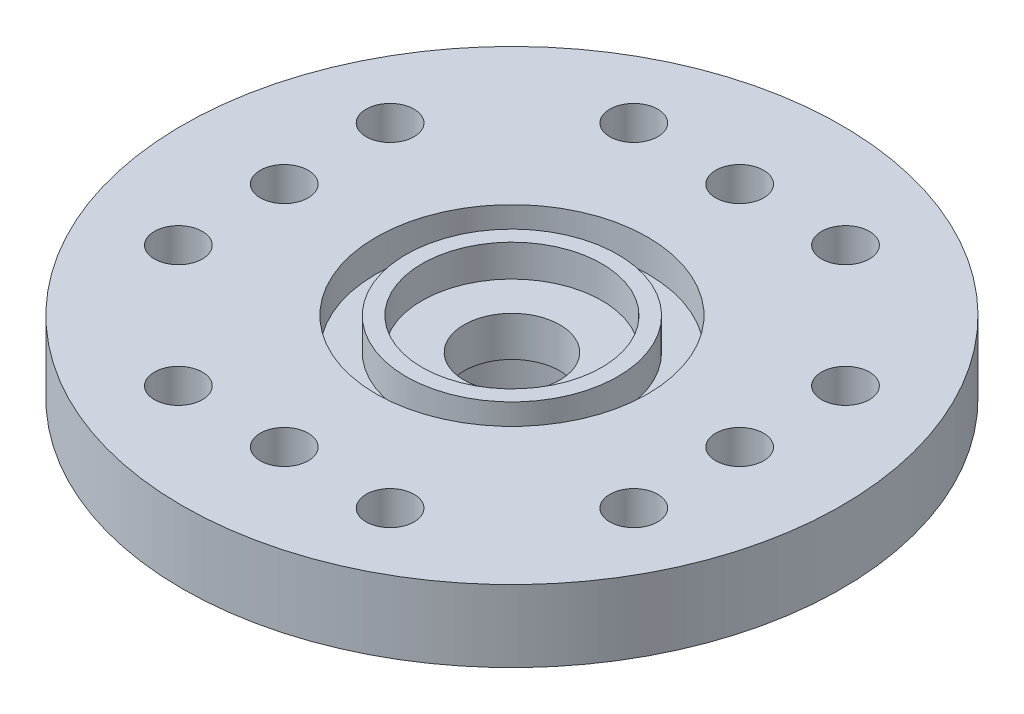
ISO-10303-21;
HEADER;
FILE_DESCRIPTION(('STEP AP214'),'2;1');
FILE_NAME('part.step','',(''),(''),'','','');
FILE_SCHEMA(('AUTOMOTIVE_DESIGN { 1 0 10303 214 1 1 1 1 }'));
ENDSEC;
DATA;
#1=APPLICATION_CONTEXT('core data for automotive mechanical design processes');
#2=APPLICATION_PROTOCOL_DEFINITION('international standard','automotive_design',2000,#1);
#3=PRODUCT_CONTEXT('',#1,'mechanical');
#4=PRODUCT('Part','Part','',(#3));
#5=PRODUCT_RELATED_PRODUCT_CATEGORY('part','',(#4));
#6=PRODUCT_DEFINITION_FORMATION('','',#4);
#7=PRODUCT_DEFINITION_CONTEXT('part definition',#1,'design');
#8=PRODUCT_DEFINITION('design','',#6,#7);
#9=PRODUCT_DEFINITION_SHAPE('','',#8);
#10=(LENGTH_UNIT() NAMED_UNIT(*) SI_UNIT(.MILLI.,.METRE.));
#11=(NAMED_UNIT(*) PLANE_ANGLE_UNIT() SI_UNIT($,.RADIAN.));
#12=(NAMED_UNIT(*) SI_UNIT($,.STERADIAN.) SOLID_ANGLE_UNIT());
#13=UNCERTAINTY_MEASURE_WITH_UNIT(LENGTH_MEASURE(1.E-05),#10,'distance_accuracy_value','');
#14=(GEOMETRIC_REPRESENTATION_CONTEXT(3) GLOBAL_UNCERTAINTY_ASSIGNED_CONTEXT((#13)) GLOBAL_UNIT_ASSIGNED_CONTEXT((#10,
#11,#12)) REPRESENTATION_CONTEXT('',''));
#15=CARTESIAN_POINT('',(0.,0.,0.));
#16=DIRECTION('',(0.,0.,1.));
#17=DIRECTION('',(1.,0.,0.));
#18=AXIS2_PLACEMENT_3D('',#15,#16,#17);
#19=CARTESIAN_POINT('',(0.,0.,0.));
#20=DIRECTION('',(0.,1.,0.));
#21=DIRECTION('',(0.,0.,1.));
#22=AXIS2_PLACEMENT_3D('',#19,#20,#21);
#23=PLANE('',#22);
#24=CARTESIAN_POINT('',(0.,0.,0.));
#25=DIRECTION('',(0.,1.,0.));
#26=DIRECTION('',(0.,0.,1.));
#27=AXIS2_PLACEMENT_3D('',#24,#25,#26);
#28=CIRCLE('',#27,1.524);
#29=CARTESIAN_POINT('',(0.,0.,1.524));
#30=VERTEX_POINT('',#29);
#31=EDGE_CURVE('E73',#30,#30,#28,.T.);
#32=ORIENTED_EDGE('',*,*,#31,.T.);
#33=EDGE_LOOP('',(#32));
#34=FACE_BOUND('',#33,.T.);
#35=CARTESIAN_POINT('',(0.,0.,0.));
#36=DIRECTION('',(0.,-1.,0.));
#37=DIRECTION('',(0.,0.,-1.));
#38=AXIS2_PLACEMENT_3D('',#35,#36,#37);
#39=CIRCLE('',#38,3.175);
#40=CARTESIAN_POINT('',(0.,0.,3.175));
#41=VERTEX_POINT('',#40);
#42=EDGE_CURVE('E157',#41,#41,#39,.T.);
#43=ORIENTED_EDGE('',*,*,#42,.T.);
#44=EDGE_LOOP('',(#43));
#45=FACE_BOUND('',#44,.T.);
#46=ADVANCED_FACE('F40',(#34,#45),#23,.F.);
#47=CARTESIAN_POINT('',(0.,2.286,0.));
#48=DIRECTION('',(0.,-1.,0.));
#49=DIRECTION('',(0.,0.,-1.));
#50=AXIS2_PLACEMENT_3D('',#47,#48,#49);
#51=CYLINDRICAL_SURFACE('',#50,1.524);
#52=ORIENTED_EDGE('',*,*,#31,.F.);
#53=EDGE_LOOP('',(#52));
#54=FACE_BOUND('',#53,.T.);
#55=CARTESIAN_POINT('',(0.,1.27,0.));
#56=DIRECTION('',(0.,1.,0.));
#57=DIRECTION('',(0.,0.,1.));
#58=AXIS2_PLACEMENT_3D('',#55,#56,#57);
#59=CIRCLE('',#58,1.524);
#60=CARTESIAN_POINT('',(0.,1.27,1.524));
#61=VERTEX_POINT('',#60);
#62=EDGE_CURVE('E136',#61,#61,#59,.F.);
#63=ORIENTED_EDGE('',*,*,#62,.F.);
#64=EDGE_LOOP('',(#63));
#65=FACE_BOUND('',#64,.T.);
#66=ADVANCED_FACE('F183',(#54,#65),#51,.F.);
#67=CARTESIAN_POINT('',(0.,2.286,0.));
#68=DIRECTION('',(0.,1.,0.));
#69=DIRECTION('',(0.,0.,1.));
#70=AXIS2_PLACEMENT_3D('',#67,#68,#69);
#71=PLANE('',#70);
#72=CARTESIAN_POINT('',(0.,2.286,0.));
#73=DIRECTION('',(0.,1.,0.));
#74=DIRECTION('',(0.,0.,1.));
#75=AXIS2_PLACEMENT_3D('',#72,#73,#74);
#76=CIRCLE('',#75,4.318);
#77=CARTESIAN_POINT('',(0.,2.286,4.318));
#78=VERTEX_POINT('',#77);
#79=EDGE_CURVE('E142',#78,#78,#76,.T.);
#80=ORIENTED_EDGE('',*,*,#79,.F.);
#81=EDGE_LOOP('',(#80));
#82=FACE_BOUND('',#81,.T.);
#83=CARTESIAN_POINT('',(-7.2390000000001,2.286,1.00180280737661E-13));
#84=DIRECTION('',(0.,1.,0.));
#85=DIRECTION('',(0.,0.,1.));
#86=AXIS2_PLACEMENT_3D('',#83,#84,#85);
#87=CIRCLE('',#86,0.761999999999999);
#88=CARTESIAN_POINT('',(-7.2390000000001,2.286,0.7620000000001));
#89=VERTEX_POINT('',#88);
#90=EDGE_CURVE('E118',#89,#89,#87,.T.);
#91=ORIENTED_EDGE('',*,*,#90,.F.);
#92=EDGE_LOOP('',(#91));
#93=FACE_BOUND('',#92,.T.);
#94=CARTESIAN_POINT('',(3.3655,2.286,7.2390000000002));
#95=DIRECTION('',(0.,1.,0.));
#96=DIRECTION('',(0.,0.,1.));
#97=AXIS2_PLACEMENT_3D('',#94,#95,#96);
#98=CIRCLE('',#97,0.761999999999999);
#99=CARTESIAN_POINT('',(3.3655,2.286,8.0010000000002));
#100=VERTEX_POINT('',#99);
#101=EDGE_CURVE('E106',#100,#100,#98,.T.);
#102=ORIENTED_EDGE('',*,*,#101,.F.);
#103=EDGE_LOOP('',(#102));
#104=FACE_BOUND('',#103,.T.);
#105=CARTESIAN_POINT('',(-3.3655,2.286,7.2390000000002));
#106=DIRECTION('',(0.,1.,0.));
#107=DIRECTION('',(0.,0.,1.));
#108=AXIS2_PLACEMENT_3D('',#105,#106,#107);
#109=CIRCLE('',#108,0.762);
#110=CARTESIAN_POINT('',(-3.3655,2.286,8.0010000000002));
#111=VERTEX_POINT('',#110);
#112=EDGE_CURVE('E94',#111,#111,#109,.T.);
#113=ORIENTED_EDGE('',*,*,#112,.F.);
#114=EDGE_LOOP('',(#113));
#115=FACE_BOUND('',#114,.T.);
#116=CARTESIAN_POINT('',(7.2390000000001,2.286,0.));
#117=DIRECTION('',(0.,1.,0.));
#118=DIRECTION('',(0.,0.,1.));
#119=AXIS2_PLACEMENT_3D('',#116,#117,#118);
#120=CIRCLE('',#119,0.762000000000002);
#121=CARTESIAN_POINT('',(7.2390000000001,2.286,0.7620000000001));
#122=VERTEX_POINT('',#121);
#123=EDGE_CURVE('E82',#122,#122,#120,.T.);
#124=ORIENTED_EDGE('',*,*,#123,.F.);
#125=EDGE_LOOP('',(#124));
#126=FACE_BOUND('',#125,.T.);
#127=CARTESIAN_POINT('',(0.,2.286,-7.239));
#128=DIRECTION('',(0.,1.,0.));
#129=DIRECTION('',(0.,0.,1.));
#130=AXIS2_PLACEMENT_3D('',#127,#128,#129);
#131=CIRCLE('',#130,0.762);
#132=CARTESIAN_POINT('',(0.,2.286,-6.477));
#133=VERTEX_POINT('',#132);
#134=EDGE_CURVE('E61',#133,#133,#131,.T.);
#135=ORIENTED_EDGE('',*,*,#134,.F.);
#136=EDGE_LOOP('',(#135));
#137=FACE_BOUND('',#136,.T.);
#138=CARTESIAN_POINT('',(0.,2.286,0.));
#139=DIRECTION('',(0.,1.,0.));
#140=DIRECTION('',(0.,0.,1.));
#141=AXIS2_PLACEMENT_3D('',#138,#139,#140);
#142=CIRCLE('',#141,10.4775);
#143=CARTESIAN_POINT('',(0.,2.286,10.4775));
#144=VERTEX_POINT('',#143);
#145=EDGE_CURVE('E47',#144,#144,#142,.T.);
#146=ORIENTED_EDGE('',*,*,#145,.T.);
#147=EDGE_LOOP('',(#146));
#148=FACE_BOUND('',#147,.T.);
#149=CARTESIAN_POINT('',(3.3655,2.286,-7.239));
#150=DIRECTION('',(0.,1.,0.));
#151=DIRECTION('',(0.,0.,1.));
#152=AXIS2_PLACEMENT_3D('',#149,#150,#151);
#153=CIRCLE('',#152,0.762);
#154=CARTESIAN_POINT('',(3.3655,2.286,-6.477));
#155=VERTEX_POINT('',#154);
#156=EDGE_CURVE('E56',#155,#155,#153,.T.);
#157=ORIENTED_EDGE('',*,*,#156,.F.);
#158=EDGE_LOOP('',(#157));
#159=FACE_BOUND('',#158,.T.);
#160=CARTESIAN_POINT('',(-3.3655,2.286,-7.239));
#161=DIRECTION('',(0.,1.,0.));
#162=DIRECTION('',(0.,0.,1.));
#163=AXIS2_PLACEMENT_3D('',#160,#161,#162);
#164=CIRCLE('',#163,0.762);
#165=CARTESIAN_POINT('',(-3.3655,2.286,-6.477));
#166=VERTEX_POINT('',#165);
#167=EDGE_CURVE('E67',#166,#166,#164,.T.);
#168=ORIENTED_EDGE('',*,*,#167,.F.);
#169=EDGE_LOOP('',(#168));
#170=FACE_BOUND('',#169,.T.);
#171=CARTESIAN_POINT('',(7.2390000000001,2.286,3.3655000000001));
#172=DIRECTION('',(0.,1.,0.));
#173=DIRECTION('',(0.,0.,1.));
#174=AXIS2_PLACEMENT_3D('',#171,#172,#173);
#175=CIRCLE('',#174,0.762000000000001);
#176=CARTESIAN_POINT('',(7.2390000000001,2.286,4.1275000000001));
#177=VERTEX_POINT('',#176);
#178=EDGE_CURVE('E78',#177,#177,#175,.T.);
#179=ORIENTED_EDGE('',*,*,#178,.F.);
#180=EDGE_LOOP('',(#179));
#181=FACE_BOUND('',#180,.T.);
#182=CARTESIAN_POINT('',(7.2390000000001,2.286,-3.3654999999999));
#183=DIRECTION('',(0.,1.,0.));
#184=DIRECTION('',(0.,0.,1.));
#185=AXIS2_PLACEMENT_3D('',#182,#183,#184);
#186=CIRCLE('',#185,0.762000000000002);
#187=CARTESIAN_POINT('',(7.2390000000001,2.286,-2.6034999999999));
#188=VERTEX_POINT('',#187);
#189=EDGE_CURVE('E88',#188,#188,#186,.T.);
#190=ORIENTED_EDGE('',*,*,#189,.F.);
#191=EDGE_LOOP('',(#190));
#192=FACE_BOUND('',#191,.T.);
#193=CARTESIAN_POINT('',(0.,2.286,7.2390000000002));
#194=DIRECTION('',(0.,1.,0.));
#195=DIRECTION('',(0.,0.,1.));
#196=AXIS2_PLACEMENT_3D('',#193,#194,#195);
#197=CIRCLE('',#196,0.762);
#198=CARTESIAN_POINT('',(0.,2.286,8.0010000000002));
#199=VERTEX_POINT('',#198);
#200=EDGE_CURVE('E100',#199,#199,#197,.T.);
#201=ORIENTED_EDGE('',*,*,#200,.F.);
#202=EDGE_LOOP('',(#201));
#203=FACE_BOUND('',#202,.T.);
#204=CARTESIAN_POINT('',(-7.2390000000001,2.286,-3.3654999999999));
#205=DIRECTION('',(0.,1.,0.));
#206=DIRECTION('',(0.,0.,1.));
#207=AXIS2_PLACEMENT_3D('',#204,#205,#206);
#208=CIRCLE('',#207,0.761999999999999);
#209=CARTESIAN_POINT('',(-7.2390000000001,2.286,-2.6034999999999));
#210=VERTEX_POINT('',#209);
#211=EDGE_CURVE('E112',#210,#210,#208,.T.);
#212=ORIENTED_EDGE('',*,*,#211,.F.);
#213=EDGE_LOOP('',(#212));
#214=FACE_BOUND('',#213,.T.);
#215=CARTESIAN_POINT('',(-7.2390000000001,2.286,3.3655000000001));
#216=DIRECTION('',(0.,1.,0.));
#217=DIRECTION('',(0.,0.,1.));
#218=AXIS2_PLACEMENT_3D('',#215,#216,#217);
#219=CIRCLE('',#218,0.761999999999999);
#220=CARTESIAN_POINT('',(-7.2390000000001,2.286,4.1275000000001));
#221=VERTEX_POINT('',#220);
#222=EDGE_CURVE('E124',#221,#221,#219,.T.);
#223=ORIENTED_EDGE('',*,*,#222,.F.);
#224=EDGE_LOOP('',(#223));
#225=FACE_BOUND('',#224,.T.);
#226=ADVANCED_FACE('F189',(#82,#93,#104,#115,#126,#137,#148,#159,#170,#181,#192,#203,#214,#225),
#71,.T.);
#227=CARTESIAN_POINT('',(0.,0.,0.));
#228=DIRECTION('',(0.,1.,0.));
#229=DIRECTION('',(0.,0.,1.));
#230=AXIS2_PLACEMENT_3D('',#227,#228,#229);
#231=CIRCLE('',#230,4.3815);
#232=CARTESIAN_POINT('',(0.,0.,4.3815));
#233=VERTEX_POINT('',#232);
#234=EDGE_CURVE('E11',#233,#233,#231,.F.);
#235=ORIENTED_EDGE('',*,*,#234,.F.);
#236=EDGE_LOOP('',(#235));
#237=FACE_BOUND('',#236,.T.);
#238=CARTESIAN_POINT('',(0.,0.,0.));
#239=DIRECTION('',(0.,1.,0.));
#240=DIRECTION('',(0.,0.,1.));
#241=AXIS2_PLACEMENT_3D('',#238,#239,#240);
#242=CIRCLE('',#241,10.4775);
#243=CARTESIAN_POINT('',(0.,0.,10.4775));
#244=VERTEX_POINT('',#243);
#245=EDGE_CURVE('E51',#244,#244,#242,.T.);
#246=ORIENTED_EDGE('',*,*,#245,.F.);
#247=EDGE_LOOP('',(#246));
#248=FACE_BOUND('',#247,.T.);
#249=CARTESIAN_POINT('',(3.3655,0.,-7.239));
#250=DIRECTION('',(0.,1.,0.));
#251=DIRECTION('',(0.,0.,1.));
#252=AXIS2_PLACEMENT_3D('',#249,#250,#251);
#253=CIRCLE('',#252,0.762);
#254=CARTESIAN_POINT('',(3.3655,0.,-6.477));
#255=VERTEX_POINT('',#254);
#256=EDGE_CURVE('E58',#255,#255,#253,.T.);
#257=ORIENTED_EDGE('',*,*,#256,.T.);
#258=EDGE_LOOP('',(#257));
#259=FACE_BOUND('',#258,.T.);
#260=CARTESIAN_POINT('',(0.,0.,-7.239));
#261=DIRECTION('',(0.,1.,0.));
#262=DIRECTION('',(0.,0.,1.));
#263=AXIS2_PLACEMENT_3D('',#260,#261,#262);
#264=CIRCLE('',#263,0.762);
#265=CARTESIAN_POINT('',(0.,0.,-6.477));
#266=VERTEX_POINT('',#265);
#267=EDGE_CURVE('E64',#266,#266,#264,.T.);
#268=ORIENTED_EDGE('',*,*,#267,.T.);
#269=EDGE_LOOP('',(#268));
#270=FACE_BOUND('',#269,.T.);
#271=CARTESIAN_POINT('',(-3.3655,0.,-7.239));
#272=DIRECTION('',(0.,1.,0.));
#273=DIRECTION('',(0.,0.,1.));
#274=AXIS2_PLACEMENT_3D('',#271,#272,#273);
#275=CIRCLE('',#274,0.762);
#276=CARTESIAN_POINT('',(-3.3655,0.,-6.477));
#277=VERTEX_POINT('',#276);
#278=EDGE_CURVE('E70',#277,#277,#275,.T.);
#279=ORIENTED_EDGE('',*,*,#278,.T.);
#280=EDGE_LOOP('',(#279));
#281=FACE_BOUND('',#280,.T.);
#282=CARTESIAN_POINT('',(7.2390000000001,0.,3.3655000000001));
#283=DIRECTION('',(0.,1.,0.));
#284=DIRECTION('',(0.,0.,1.));
#285=AXIS2_PLACEMENT_3D('',#282,#283,#284);
#286=CIRCLE('',#285,0.762000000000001);
#287=CARTESIAN_POINT('',(7.2390000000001,0.,4.1275000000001));
#288=VERTEX_POINT('',#287);
#289=EDGE_CURVE('E79',#288,#288,#286,.T.);
#290=ORIENTED_EDGE('',*,*,#289,.T.);
#291=EDGE_LOOP('',(#290));
#292=FACE_BOUND('',#291,.T.);
#293=CARTESIAN_POINT('',(7.2390000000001,0.,0.));
#294=DIRECTION('',(0.,1.,0.));
#295=DIRECTION('',(0.,0.,1.));
#296=AXIS2_PLACEMENT_3D('',#293,#294,#295);
#297=CIRCLE('',#296,0.762000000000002);
#298=CARTESIAN_POINT('',(7.2390000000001,0.,0.7620000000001));
#299=VERTEX_POINT('',#298);
#300=EDGE_CURVE('E85',#299,#299,#297,.T.);
#301=ORIENTED_EDGE('',*,*,#300,.T.);
#302=EDGE_LOOP('',(#301));
#303=FACE_BOUND('',#302,.T.);
#304=CARTESIAN_POINT('',(7.2390000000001,0.,-3.3654999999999));
#305=DIRECTION('',(0.,1.,0.));
#306=DIRECTION('',(0.,0.,1.));
#307=AXIS2_PLACEMENT_3D('',#304,#305,#306);
#308=CIRCLE('',#307,0.762000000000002);
#309=CARTESIAN_POINT('',(7.2390000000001,0.,-2.6034999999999));
#310=VERTEX_POINT('',#309);
#311=EDGE_CURVE('E91',#310,#310,#308,.T.);
#312=ORIENTED_EDGE('',*,*,#311,.T.);
#313=EDGE_LOOP('',(#312));
#314=FACE_BOUND('',#313,.T.);
#315=CARTESIAN_POINT('',(-3.3655,0.,7.2390000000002));
#316=DIRECTION('',(0.,1.,0.));
#317=DIRECTION('',(0.,0.,1.));
#318=AXIS2_PLACEMENT_3D('',#315,#316,#317);
#319=CIRCLE('',#318,0.762);
#320=CARTESIAN_POINT('',(-3.3655,0.,8.0010000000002));
#321=VERTEX_POINT('',#320);
#322=EDGE_CURVE('E97',#321,#321,#319,.T.);
#323=ORIENTED_EDGE('',*,*,#322,.T.);
#324=EDGE_LOOP('',(#323));
#325=FACE_BOUND('',#324,.T.);
#326=CARTESIAN_POINT('',(0.,0.,7.2390000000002));
#327=DIRECTION('',(0.,1.,0.));
#328=DIRECTION('',(0.,0.,1.));
#329=AXIS2_PLACEMENT_3D('',#326,#327,#328);
#330=CIRCLE('',#329,0.762);
#331=CARTESIAN_POINT('',(0.,0.,8.0010000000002));
#332=VERTEX_POINT('',#331);
#333=EDGE_CURVE('E103',#332,#332,#330,.T.);
#334=ORIENTED_EDGE('',*,*,#333,.T.);
#335=EDGE_LOOP('',(#334));
#336=FACE_BOUND('',#335,.T.);
#337=CARTESIAN_POINT('',(3.3655,0.,7.2390000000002));
#338=DIRECTION('',(0.,1.,0.));
#339=DIRECTION('',(0.,0.,1.));
#340=AXIS2_PLACEMENT_3D('',#337,#338,#339);
#341=CIRCLE('',#340,0.761999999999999);
#342=CARTESIAN_POINT('',(3.3655,0.,8.0010000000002));
#343=VERTEX_POINT('',#342);
#344=EDGE_CURVE('E109',#343,#343,#341,.T.);
#345=ORIENTED_EDGE('',*,*,#344,.T.);
#346=EDGE_LOOP('',(#345));
#347=FACE_BOUND('',#346,.T.);
#348=CARTESIAN_POINT('',(-7.2390000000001,0.,-3.3654999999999));
#349=DIRECTION('',(0.,1.,0.));
#350=DIRECTION('',(0.,0.,1.));
#351=AXIS2_PLACEMENT_3D('',#348,#349,#350);
#352=CIRCLE('',#351,0.761999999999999);
#353=CARTESIAN_POINT('',(-7.2390000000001,0.,-2.6034999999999));
#354=VERTEX_POINT('',#353);
#355=EDGE_CURVE('E115',#354,#354,#352,.T.);
#356=ORIENTED_EDGE('',*,*,#355,.T.);
#357=EDGE_LOOP('',(#356));
#358=FACE_BOUND('',#357,.T.);
#359=CARTESIAN_POINT('',(-7.2390000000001,0.,1.00180280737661E-13));
#360=DIRECTION('',(0.,1.,0.));
#361=DIRECTION('',(0.,0.,1.));
#362=AXIS2_PLACEMENT_3D('',#359,#360,#361);
#363=CIRCLE('',#362,0.761999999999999);
#364=CARTESIAN_POINT('',(-7.2390000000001,0.,0.7620000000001));
#365=VERTEX_POINT('',#364);
#366=EDGE_CURVE('E121',#365,#365,#363,.T.);
#367=ORIENTED_EDGE('',*,*,#366,.T.);
#368=EDGE_LOOP('',(#367));
#369=FACE_BOUND('',#368,.T.);
#370=CARTESIAN_POINT('',(-7.2390000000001,0.,3.3655000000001));
#371=DIRECTION('',(0.,1.,0.));
#372=DIRECTION('',(0.,0.,1.));
#373=AXIS2_PLACEMENT_3D('',#370,#371,#372);
#374=CIRCLE('',#373,0.761999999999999);
#375=CARTESIAN_POINT('',(-7.2390000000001,0.,4.1275000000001));
#376=VERTEX_POINT('',#375);
#377=EDGE_CURVE('E127',#376,#376,#374,.T.);
#378=ORIENTED_EDGE('',*,*,#377,.T.);
#379=EDGE_LOOP('',(#378));
#380=FACE_BOUND('',#379,.T.);
#381=ADVANCED_FACE('F185',(#237,#248,#259,#270,#281,#292,#303,#314,#325,#336,#347,#358,#369,
#380),#23,.F.);
#382=CARTESIAN_POINT('',(0.,2.286,0.));
#383=DIRECTION('',(0.,-1.,0.));
#384=DIRECTION('',(0.,0.,-1.));
#385=AXIS2_PLACEMENT_3D('',#382,#383,#384);
#386=CYLINDRICAL_SURFACE('',#385,10.4775);
#387=ORIENTED_EDGE('',*,*,#145,.F.);
#388=EDGE_LOOP('',(#387));
#389=FACE_BOUND('',#388,.T.);
#390=ORIENTED_EDGE('',*,*,#245,.T.);
#391=EDGE_LOOP('',(#390));
#392=FACE_BOUND('',#391,.T.);
#393=ADVANCED_FACE('F42',(#389,#392),#386,.T.);
#394=CARTESIAN_POINT('',(3.3655,2.286,-7.239));
#395=DIRECTION('',(0.,-1.,0.));
#396=DIRECTION('',(0.,0.,-1.));
#397=AXIS2_PLACEMENT_3D('',#394,#395,#396);
#398=CYLINDRICAL_SURFACE('',#397,0.762);
#399=ORIENTED_EDGE('',*,*,#156,.T.);
#400=EDGE_LOOP('',(#399));
#401=FACE_BOUND('',#400,.T.);
#402=ORIENTED_EDGE('',*,*,#256,.F.);
#403=EDGE_LOOP('',(#402));
#404=FACE_BOUND('',#403,.T.);
#405=ADVANCED_FACE('F200',(#401,#404),#398,.F.);
#406=CARTESIAN_POINT('',(0.,2.286,-7.239));
#407=DIRECTION('',(0.,-1.,0.));
#408=DIRECTION('',(0.,0.,-1.));
#409=AXIS2_PLACEMENT_3D('',#406,#407,#408);
#410=CYLINDRICAL_SURFACE('',#409,0.762);
#411=ORIENTED_EDGE('',*,*,#134,.T.);
#412=EDGE_LOOP('',(#411));
#413=FACE_BOUND('',#412,.T.);
#414=ORIENTED_EDGE('',*,*,#267,.F.);
#415=EDGE_LOOP('',(#414));
#416=FACE_BOUND('',#415,.T.);
#417=ADVANCED_FACE('F279',(#413,#416),#410,.F.);
#418=CARTESIAN_POINT('',(-3.3655,2.286,-7.239));
#419=DIRECTION('',(0.,-1.,0.));
#420=DIRECTION('',(0.,0.,-1.));
#421=AXIS2_PLACEMENT_3D('',#418,#419,#420);
#422=CYLINDRICAL_SURFACE('',#421,0.762);
#423=ORIENTED_EDGE('',*,*,#167,.T.);
#424=EDGE_LOOP('',(#423));
#425=FACE_BOUND('',#424,.T.);
#426=ORIENTED_EDGE('',*,*,#278,.F.);
#427=EDGE_LOOP('',(#426));
#428=FACE_BOUND('',#427,.T.);
#429=ADVANCED_FACE('F274',(#425,#428),#422,.F.);
#430=CARTESIAN_POINT('',(7.2390000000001,2.286,3.3655000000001));
#431=DIRECTION('',(0.,-1.,0.));
#432=DIRECTION('',(0.,0.,-1.));
#433=AXIS2_PLACEMENT_3D('',#430,#431,#432);
#434=CYLINDRICAL_SURFACE('',#433,0.762000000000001);
#435=ORIENTED_EDGE('',*,*,#178,.T.);
#436=EDGE_LOOP('',(#435));
#437=FACE_BOUND('',#436,.T.);
#438=ORIENTED_EDGE('',*,*,#289,.F.);
#439=EDGE_LOOP('',(#438));
#440=FACE_BOUND('',#439,.T.);
#441=ADVANCED_FACE('F271',(#437,#440),#434,.F.);
#442=CARTESIAN_POINT('',(7.2390000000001,2.286,0.));
#443=DIRECTION('',(0.,-1.,0.));
#444=DIRECTION('',(0.,0.,-1.));
#445=AXIS2_PLACEMENT_3D('',#442,#443,#444);
#446=CYLINDRICAL_SURFACE('',#445,0.762000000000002);
#447=ORIENTED_EDGE('',*,*,#123,.T.);
#448=EDGE_LOOP('',(#447));
#449=FACE_BOUND('',#448,.T.);
#450=ORIENTED_EDGE('',*,*,#300,.F.);
#451=EDGE_LOOP('',(#450));
#452=FACE_BOUND('',#451,.T.);
#453=ADVANCED_FACE('F267',(#449,#452),#446,.F.);
#454=CARTESIAN_POINT('',(7.2390000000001,2.286,-3.3654999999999));
#455=DIRECTION('',(0.,-1.,0.));
#456=DIRECTION('',(0.,0.,-1.));
#457=AXIS2_PLACEMENT_3D('',#454,#455,#456);
#458=CYLINDRICAL_SURFACE('',#457,0.762000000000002);
#459=ORIENTED_EDGE('',*,*,#189,.T.);
#460=EDGE_LOOP('',(#459));
#461=FACE_BOUND('',#460,.T.);
#462=ORIENTED_EDGE('',*,*,#311,.F.);
#463=EDGE_LOOP('',(#462));
#464=FACE_BOUND('',#463,.T.);
#465=ADVANCED_FACE('F263',(#461,#464),#458,.F.);
#466=CARTESIAN_POINT('',(-3.3655,2.286,7.2390000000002));
#467=DIRECTION('',(0.,-1.,0.));
#468=DIRECTION('',(0.,0.,-1.));
#469=AXIS2_PLACEMENT_3D('',#466,#467,#468);
#470=CYLINDRICAL_SURFACE('',#469,0.762);
#471=ORIENTED_EDGE('',*,*,#112,.T.);
#472=EDGE_LOOP('',(#471));
#473=FACE_BOUND('',#472,.T.);
#474=ORIENTED_EDGE('',*,*,#322,.F.);
#475=EDGE_LOOP('',(#474));
#476=FACE_BOUND('',#475,.T.);
#477=ADVANCED_FACE('F259',(#473,#476),#470,.F.);
#478=CARTESIAN_POINT('',(0.,2.286,7.2390000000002));
#479=DIRECTION('',(0.,-1.,0.));
#480=DIRECTION('',(0.,0.,-1.));
#481=AXIS2_PLACEMENT_3D('',#478,#479,#480);
#482=CYLINDRICAL_SURFACE('',#481,0.762);
#483=ORIENTED_EDGE('',*,*,#200,.T.);
#484=EDGE_LOOP('',(#483));
#485=FACE_BOUND('',#484,.T.);
#486=ORIENTED_EDGE('',*,*,#333,.F.);
#487=EDGE_LOOP('',(#486));
#488=FACE_BOUND('',#487,.T.);
#489=ADVANCED_FACE('F255',(#485,#488),#482,.F.);
#490=CARTESIAN_POINT('',(3.3655,2.286,7.2390000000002));
#491=DIRECTION('',(0.,-1.,0.));
#492=DIRECTION('',(0.,0.,-1.));
#493=AXIS2_PLACEMENT_3D('',#490,#491,#492);
#494=CYLINDRICAL_SURFACE('',#493,0.761999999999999);
#495=ORIENTED_EDGE('',*,*,#101,.T.);
#496=EDGE_LOOP('',(#495));
#497=FACE_BOUND('',#496,.T.);
#498=ORIENTED_EDGE('',*,*,#344,.F.);
#499=EDGE_LOOP('',(#498));
#500=FACE_BOUND('',#499,.T.);
#501=ADVANCED_FACE('F251',(#497,#500),#494,.F.);
#502=CARTESIAN_POINT('',(-7.2390000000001,2.286,-3.3654999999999));
#503=DIRECTION('',(0.,-1.,0.));
#504=DIRECTION('',(0.,0.,-1.));
#505=AXIS2_PLACEMENT_3D('',#502,#503,#504);
#506=CYLINDRICAL_SURFACE('',#505,0.761999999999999);
#507=ORIENTED_EDGE('',*,*,#211,.T.);
#508=EDGE_LOOP('',(#507));
#509=FACE_BOUND('',#508,.T.);
#510=ORIENTED_EDGE('',*,*,#355,.F.);
#511=EDGE_LOOP('',(#510));
#512=FACE_BOUND('',#511,.T.);
#513=ADVANCED_FACE('F244',(#509,#512),#506,.F.);
#514=CARTESIAN_POINT('',(-7.2390000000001,2.286,1.00180280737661E-13));
#515=DIRECTION('',(0.,-1.,0.));
#516=DIRECTION('',(0.,0.,-1.));
#517=AXIS2_PLACEMENT_3D('',#514,#515,#516);
#518=CYLINDRICAL_SURFACE('',#517,0.761999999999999);
#519=ORIENTED_EDGE('',*,*,#90,.T.);
#520=EDGE_LOOP('',(#519));
#521=FACE_BOUND('',#520,.T.);
#522=ORIENTED_EDGE('',*,*,#366,.F.);
#523=EDGE_LOOP('',(#522));
#524=FACE_BOUND('',#523,.T.);
#525=ADVANCED_FACE('F234',(#521,#524),#518,.F.);
#526=CARTESIAN_POINT('',(-7.2390000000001,2.286,3.3655000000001));
#527=DIRECTION('',(0.,-1.,0.));
#528=DIRECTION('',(0.,0.,-1.));
#529=AXIS2_PLACEMENT_3D('',#526,#527,#528);
#530=CYLINDRICAL_SURFACE('',#529,0.761999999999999);
#531=ORIENTED_EDGE('',*,*,#222,.T.);
#532=EDGE_LOOP('',(#531));
#533=FACE_BOUND('',#532,.T.);
#534=ORIENTED_EDGE('',*,*,#377,.F.);
#535=EDGE_LOOP('',(#534));
#536=FACE_BOUND('',#535,.T.);
#537=ADVANCED_FACE('F231',(#533,#536),#530,.F.);
#538=CARTESIAN_POINT('',(0.,1.27,0.));
#539=DIRECTION('',(0.,1.,0.));
#540=DIRECTION('',(0.,0.,1.));
#541=AXIS2_PLACEMENT_3D('',#538,#539,#540);
#542=CYLINDRICAL_SURFACE('',#541,2.8575);
#543=CARTESIAN_POINT('',(0.,1.27,0.));
#544=DIRECTION('',(0.,1.,0.));
#545=DIRECTION('',(0.,0.,1.));
#546=AXIS2_PLACEMENT_3D('',#543,#544,#545);
#547=CIRCLE('',#546,2.8575);
#548=CARTESIAN_POINT('',(0.,1.27,2.8575));
#549=VERTEX_POINT('',#548);
#550=EDGE_CURVE('E130',#549,#549,#547,.T.);
#551=ORIENTED_EDGE('',*,*,#550,.F.);
#552=EDGE_LOOP('',(#551));
#553=FACE_BOUND('',#552,.T.);
#554=CARTESIAN_POINT('',(0.,2.286,0.));
#555=DIRECTION('',(0.,1.,0.));
#556=DIRECTION('',(0.,0.,1.));
#557=AXIS2_PLACEMENT_3D('',#554,#555,#556);
#558=CIRCLE('',#557,2.8575);
#559=CARTESIAN_POINT('',(0.,2.286,2.8575));
#560=VERTEX_POINT('',#559);
#561=EDGE_CURVE('E133',#560,#560,#558,.T.);
#562=ORIENTED_EDGE('',*,*,#561,.T.);
#563=EDGE_LOOP('',(#562));
#564=FACE_BOUND('',#563,.T.);
#565=ADVANCED_FACE('F233',(#553,#564),#542,.F.);
#566=CARTESIAN_POINT('',(0.,1.27,0.));
#567=DIRECTION('',(0.,1.,0.));
#568=DIRECTION('',(0.,0.,1.));
#569=AXIS2_PLACEMENT_3D('',#566,#567,#568);
#570=PLANE('',#569);
#571=ORIENTED_EDGE('',*,*,#62,.T.);
#572=EDGE_LOOP('',(#571));
#573=FACE_BOUND('',#572,.T.);
#574=ORIENTED_EDGE('',*,*,#550,.T.);
#575=EDGE_LOOP('',(#574));
#576=FACE_BOUND('',#575,.T.);
#577=ADVANCED_FACE('F241',(#573,#576),#570,.T.);
#578=ORIENTED_EDGE('',*,*,#561,.F.);
#579=EDGE_LOOP('',(#578));
#580=FACE_BOUND('',#579,.T.);
#581=CARTESIAN_POINT('',(0.,2.286,0.));
#582=DIRECTION('',(0.,1.,0.));
#583=DIRECTION('',(0.,0.,1.));
#584=AXIS2_PLACEMENT_3D('',#581,#582,#583);
#585=CIRCLE('',#584,3.3655);
#586=CARTESIAN_POINT('',(0.,2.286,3.3655));
#587=VERTEX_POINT('',#586);
#588=EDGE_CURVE('E146',#587,#587,#585,.T.);
#589=ORIENTED_EDGE('',*,*,#588,.T.);
#590=EDGE_LOOP('',(#589));
#591=FACE_BOUND('',#590,.T.);
#592=ADVANCED_FACE('F203',(#580,#591),#71,.T.);
#593=CARTESIAN_POINT('',(0.,1.27,0.));
#594=DIRECTION('',(0.,1.,0.));
#595=DIRECTION('',(0.,0.,1.));
#596=AXIS2_PLACEMENT_3D('',#593,#594,#595);
#597=CYLINDRICAL_SURFACE('',#596,3.3655);
#598=CARTESIAN_POINT('',(0.,1.27,0.));
#599=DIRECTION('',(0.,1.,0.));
#600=DIRECTION('',(0.,0.,1.));
#601=AXIS2_PLACEMENT_3D('',#598,#599,#600);
#602=CIRCLE('',#601,3.3655);
#603=CARTESIAN_POINT('',(0.,1.27,3.3655));
#604=VERTEX_POINT('',#603);
#605=EDGE_CURVE('E145',#604,#604,#602,.T.);
#606=ORIENTED_EDGE('',*,*,#605,.T.);
#607=EDGE_LOOP('',(#606));
#608=FACE_BOUND('',#607,.T.);
#609=ORIENTED_EDGE('',*,*,#588,.F.);
#610=EDGE_LOOP('',(#609));
#611=FACE_BOUND('',#610,.T.);
#612=ADVANCED_FACE('F391',(#608,#611),#597,.T.);
#613=CARTESIAN_POINT('',(0.,1.27,0.));
#614=DIRECTION('',(0.,1.,0.));
#615=DIRECTION('',(0.,0.,1.));
#616=AXIS2_PLACEMENT_3D('',#613,#614,#615);
#617=CYLINDRICAL_SURFACE('',#616,4.318);
#618=CARTESIAN_POINT('',(0.,1.27,0.));
#619=DIRECTION('',(0.,1.,0.));
#620=DIRECTION('',(0.,0.,1.));
#621=AXIS2_PLACEMENT_3D('',#618,#619,#620);
#622=CIRCLE('',#621,4.318);
#623=CARTESIAN_POINT('',(0.,1.27,4.318));
#624=VERTEX_POINT('',#623);
#625=EDGE_CURVE('E137',#624,#624,#622,.T.);
#626=ORIENTED_EDGE('',*,*,#625,.F.);
#627=EDGE_LOOP('',(#626));
#628=FACE_BOUND('',#627,.T.);
#629=ORIENTED_EDGE('',*,*,#79,.T.);
#630=EDGE_LOOP('',(#629));
#631=FACE_BOUND('',#630,.T.);
#632=ADVANCED_FACE('F178',(#628,#631),#617,.F.);
#633=CARTESIAN_POINT('',(0.,1.27,0.));
#634=DIRECTION('',(0.,1.,0.));
#635=DIRECTION('',(0.,0.,1.));
#636=AXIS2_PLACEMENT_3D('',#633,#634,#635);
#637=PLANE('',#636);
#638=ORIENTED_EDGE('',*,*,#605,.F.);
#639=EDGE_LOOP('',(#638));
#640=FACE_BOUND('',#639,.T.);
#641=ORIENTED_EDGE('',*,*,#625,.T.);
#642=EDGE_LOOP('',(#641));
#643=FACE_BOUND('',#642,.T.);
#644=ADVANCED_FACE('F169',(#640,#643),#637,.T.);
#645=CARTESIAN_POINT('',(0.,-3.048,0.));
#646=DIRECTION('',(0.,-1.,0.));
#647=DIRECTION('',(0.,0.,-1.));
#648=AXIS2_PLACEMENT_3D('',#645,#646,#647);
#649=PLANE('',#648);
#650=CARTESIAN_POINT('',(0.,-3.048,0.));
#651=DIRECTION('',(0.,-1.,0.));
#652=DIRECTION('',(0.,0.,-1.));
#653=AXIS2_PLACEMENT_3D('',#650,#651,#652);
#654=CIRCLE('',#653,4.3815);
#655=CARTESIAN_POINT('',(0.,-3.048,4.3815));
#656=VERTEX_POINT('',#655);
#657=EDGE_CURVE('E149',#656,#656,#654,.T.);
#658=ORIENTED_EDGE('',*,*,#657,.T.);
#659=EDGE_LOOP('',(#658));
#660=FACE_BOUND('',#659,.T.);
#661=CARTESIAN_POINT('',(0.,-3.048,0.));
#662=DIRECTION('',(0.,-1.,0.));
#663=DIRECTION('',(0.,0.,-1.));
#664=AXIS2_PLACEMENT_3D('',#661,#662,#663);
#665=CIRCLE('',#664,3.175);
#666=CARTESIAN_POINT('',(0.,-3.048,3.175));
#667=VERTEX_POINT('',#666);
#668=EDGE_CURVE('E156',#667,#667,#665,.T.);
#669=ORIENTED_EDGE('',*,*,#668,.F.);
#670=EDGE_LOOP('',(#669));
#671=FACE_BOUND('',#670,.T.);
#672=ADVANCED_FACE('F166',(#660,#671),#649,.T.);
#673=CARTESIAN_POINT('',(0.,-3.048,0.));
#674=DIRECTION('',(0.,1.,0.));
#675=DIRECTION('',(0.,0.,1.));
#676=AXIS2_PLACEMENT_3D('',#673,#674,#675);
#677=CYLINDRICAL_SURFACE('',#676,4.3815);
#678=CARTESIAN_POINT('',(0.,-3.048,4.3815));
#679=CARTESIAN_POINT('',(0.,-3.01625,4.3815));
#680=CARTESIAN_POINT('',(0.,-2.9845,4.3815));
#681=CARTESIAN_POINT('',(0.,-2.921,4.3815));
#682=CARTESIAN_POINT('',(0.,-2.88925,4.3815));
#683=CARTESIAN_POINT('',(0.,-2.82575,4.3815));
#684=CARTESIAN_POINT('',(0.,-2.794,4.3815));
#685=CARTESIAN_POINT('',(0.,-2.7305,4.3815));
#686=CARTESIAN_POINT('',(0.,-2.69875,4.3815));
#687=CARTESIAN_POINT('',(0.,-2.63525,4.3815));
#688=CARTESIAN_POINT('',(0.,-2.6035,4.3815));
#689=CARTESIAN_POINT('',(0.,-2.54,4.3815));
#690=CARTESIAN_POINT('',(0.,-2.50825,4.3815));
#691=CARTESIAN_POINT('',(0.,-2.44475,4.3815));
#692=CARTESIAN_POINT('',(0.,-2.413,4.3815));
#693=CARTESIAN_POINT('',(0.,-2.3495,4.3815));
#694=CARTESIAN_POINT('',(0.,-2.31775,4.3815));
#695=CARTESIAN_POINT('',(0.,-2.25425,4.3815));
#696=CARTESIAN_POINT('',(0.,-2.2225,4.3815));
#697=CARTESIAN_POINT('',(0.,-2.159,4.3815));
#698=CARTESIAN_POINT('',(0.,-2.12725,4.3815));
#699=CARTESIAN_POINT('',(0.,-2.06375,4.3815));
#700=CARTESIAN_POINT('',(0.,-2.032,4.3815));
#701=CARTESIAN_POINT('',(0.,-1.9685,4.3815));
#702=CARTESIAN_POINT('',(0.,-1.93675,4.3815));
#703=CARTESIAN_POINT('',(0.,-1.87325,4.3815));
#704=CARTESIAN_POINT('',(0.,-1.8415,4.3815));
#705=CARTESIAN_POINT('',(0.,-1.778,4.3815));
#706=CARTESIAN_POINT('',(0.,-1.74625,4.3815));
#707=CARTESIAN_POINT('',(0.,-1.68275,4.3815));
#708=CARTESIAN_POINT('',(0.,-1.651,4.3815));
#709=CARTESIAN_POINT('',(0.,-1.5875,4.3815));
#710=CARTESIAN_POINT('',(0.,-1.55575,4.3815));
#711=CARTESIAN_POINT('',(0.,-1.49225,4.3815));
#712=CARTESIAN_POINT('',(0.,-1.4605,4.3815));
#713=CARTESIAN_POINT('',(0.,-1.397,4.3815));
#714=CARTESIAN_POINT('',(0.,-1.36525,4.3815));
#715=CARTESIAN_POINT('',(0.,-1.30175,4.3815));
#716=CARTESIAN_POINT('',(0.,-1.27,4.3815));
#717=CARTESIAN_POINT('',(0.,-1.2065,4.3815));
#718=CARTESIAN_POINT('',(0.,-1.17475,4.3815));
#719=CARTESIAN_POINT('',(0.,-1.11125,4.3815));
#720=CARTESIAN_POINT('',(0.,-1.0795,4.3815));
#721=CARTESIAN_POINT('',(0.,-1.016,4.3815));
#722=CARTESIAN_POINT('',(0.,-0.98425,4.3815));
#723=CARTESIAN_POINT('',(0.,-0.92075,4.3815));
#724=CARTESIAN_POINT('',(0.,-0.889,4.3815));
#725=CARTESIAN_POINT('',(0.,-0.8255,4.3815));
#726=CARTESIAN_POINT('',(0.,-0.79375,4.3815));
#727=CARTESIAN_POINT('',(0.,-0.73025,4.3815));
#728=CARTESIAN_POINT('',(0.,-0.6985,4.3815));
#729=CARTESIAN_POINT('',(0.,-0.635,4.3815));
#730=CARTESIAN_POINT('',(0.,-0.60325,4.3815));
#731=CARTESIAN_POINT('',(0.,-0.53975,4.3815));
#732=CARTESIAN_POINT('',(0.,-0.508,4.3815));
#733=CARTESIAN_POINT('',(0.,-0.4445,4.3815));
#734=CARTESIAN_POINT('',(0.,-0.41275,4.3815));
#735=CARTESIAN_POINT('',(0.,-0.34925,4.3815));
#736=CARTESIAN_POINT('',(0.,-0.3175,4.3815));
#737=CARTESIAN_POINT('',(0.,-0.254,4.3815));
#738=CARTESIAN_POINT('',(0.,-0.22225,4.3815));
#739=CARTESIAN_POINT('',(0.,-0.15875,4.3815));
#740=CARTESIAN_POINT('',(0.,-0.127,4.3815));
#741=CARTESIAN_POINT('',(0.,-0.0634999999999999,4.3815));
#742=CARTESIAN_POINT('',(0.,-0.03175,4.3815));
#743=CARTESIAN_POINT('',(0.,0.,4.3815));
#744=B_SPLINE_CURVE_WITH_KNOTS('',3,(#678,#679,#680,#681,#682,#683,#684,#685,#686,#687,#688,
#689,#690,#691,#692,#693,#694,#695,#696,#697,#698,#699,#700,#701,#702,#703,#704,#705,#706,#707,
#708,#709,#710,#711,#712,#713,#714,#715,#716,#717,#718,#719,#720,#721,#722,#723,#724,#725,#726,
#727,#728,#729,#730,#731,#732,#733,#734,#735,#736,#737,#738,#739,#740,#741,#742,#743),
.UNSPECIFIED.,.F.,.F.,(4,2,2,2,2,2,2,2,2,2,2,2,2,2,2,2,2,2,2,2,2,2,2,2,2,2,2,2,2,2,2,2,4),(0.,
0.0952500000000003,0.1905,0.28575,0.381,0.47625,0.5715,0.66675,0.762,0.85725,0.9525,1.04775,
1.143,1.23825,1.3335,1.42875,1.524,1.61925,1.7145,1.80975,1.905,2.00025,2.0955,2.19075,2.286,
2.38125,2.4765,2.57175,2.667,2.76225,2.8575,2.95275,3.048),.UNSPECIFIED.);
#745=EDGE_CURVE('BSEAM168',#656,#233,#744,.T.);
#746=ORIENTED_EDGE('',*,*,#657,.F.);
#747=ORIENTED_EDGE('',*,*,#234,.T.);
#748=ORIENTED_EDGE('',*,*,#745,.T.);
#749=ORIENTED_EDGE('',*,*,#745,.F.);
#750=EDGE_LOOP('',(#746,#748,#747,#749));
#751=FACE_BOUND('',#750,.T.);
#752=ADVANCED_FACE('F168',(#751),#677,.T.);
#753=CARTESIAN_POINT('',(0.,-3.048,0.));
#754=DIRECTION('',(0.,1.,0.));
#755=DIRECTION('',(0.,0.,1.));
#756=AXIS2_PLACEMENT_3D('',#753,#754,#755);
#757=CYLINDRICAL_SURFACE('',#756,3.175);
#758=CARTESIAN_POINT('',(0.,-3.048,3.175));
#759=CARTESIAN_POINT('',(0.,-3.01625,3.175));
#760=CARTESIAN_POINT('',(0.,-2.9845,3.175));
#761=CARTESIAN_POINT('',(0.,-2.921,3.175));
#762=CARTESIAN_POINT('',(0.,-2.88925,3.175));
#763=CARTESIAN_POINT('',(0.,-2.82575,3.175));
#764=CARTESIAN_POINT('',(0.,-2.794,3.175));
#765=CARTESIAN_POINT('',(0.,-2.7305,3.175));
#766=CARTESIAN_POINT('',(0.,-2.69875,3.175));
#767=CARTESIAN_POINT('',(0.,-2.63525,3.175));
#768=CARTESIAN_POINT('',(0.,-2.6035,3.175));
#769=CARTESIAN_POINT('',(0.,-2.54,3.175));
#770=CARTESIAN_POINT('',(0.,-2.50825,3.175));
#771=CARTESIAN_POINT('',(0.,-2.44475,3.175));
#772=CARTESIAN_POINT('',(0.,-2.413,3.175));
#773=CARTESIAN_POINT('',(0.,-2.3495,3.175));
#774=CARTESIAN_POINT('',(0.,-2.31775,3.175));
#775=CARTESIAN_POINT('',(0.,-2.25425,3.175));
#776=CARTESIAN_POINT('',(0.,-2.2225,3.175));
#777=CARTESIAN_POINT('',(0.,-2.159,3.175));
#778=CARTESIAN_POINT('',(0.,-2.12725,3.175));
#779=CARTESIAN_POINT('',(0.,-2.06375,3.175));
#780=CARTESIAN_POINT('',(0.,-2.032,3.175));
#781=CARTESIAN_POINT('',(0.,-1.9685,3.175));
#782=CARTESIAN_POINT('',(0.,-1.93675,3.175));
#783=CARTESIAN_POINT('',(0.,-1.87325,3.175));
#784=CARTESIAN_POINT('',(0.,-1.8415,3.175));
#785=CARTESIAN_POINT('',(0.,-1.778,3.175));
#786=CARTESIAN_POINT('',(0.,-1.74625,3.175));
#787=CARTESIAN_POINT('',(0.,-1.68275,3.175));
#788=CARTESIAN_POINT('',(0.,-1.651,3.175));
#789=CARTESIAN_POINT('',(0.,-1.5875,3.175));
#790=CARTESIAN_POINT('',(0.,-1.55575,3.175));
#791=CARTESIAN_POINT('',(0.,-1.49225,3.175));
#792=CARTESIAN_POINT('',(0.,-1.4605,3.175));
#793=CARTESIAN_POINT('',(0.,-1.397,3.175));
#794=CARTESIAN_POINT('',(0.,-1.36525,3.175));
#795=CARTESIAN_POINT('',(0.,-1.30175,3.175));
#796=CARTESIAN_POINT('',(0.,-1.27,3.175));
#797=CARTESIAN_POINT('',(0.,-1.2065,3.175));
#798=CARTESIAN_POINT('',(0.,-1.17475,3.175));
#799=CARTESIAN_POINT('',(0.,-1.11125,3.175));
#800=CARTESIAN_POINT('',(0.,-1.0795,3.175));
#801=CARTESIAN_POINT('',(0.,-1.016,3.175));
#802=CARTESIAN_POINT('',(0.,-0.98425,3.175));
#803=CARTESIAN_POINT('',(0.,-0.92075,3.175));
#804=CARTESIAN_POINT('',(0.,-0.889,3.175));
#805=CARTESIAN_POINT('',(0.,-0.8255,3.175));
#806=CARTESIAN_POINT('',(0.,-0.79375,3.175));
#807=CARTESIAN_POINT('',(0.,-0.73025,3.175));
#808=CARTESIAN_POINT('',(0.,-0.6985,3.175));
#809=CARTESIAN_POINT('',(0.,-0.635,3.175));
#810=CARTESIAN_POINT('',(0.,-0.60325,3.175));
#811=CARTESIAN_POINT('',(0.,-0.53975,3.175));
#812=CARTESIAN_POINT('',(0.,-0.508,3.175));
#813=CARTESIAN_POINT('',(0.,-0.4445,3.175));
#814=CARTESIAN_POINT('',(0.,-0.41275,3.175));
#815=CARTESIAN_POINT('',(0.,-0.34925,3.175));
#816=CARTESIAN_POINT('',(0.,-0.3175,3.175));
#817=CARTESIAN_POINT('',(0.,-0.254,3.175));
#818=CARTESIAN_POINT('',(0.,-0.22225,3.175));
#819=CARTESIAN_POINT('',(0.,-0.15875,3.175));
#820=CARTESIAN_POINT('',(0.,-0.127,3.175));
#821=CARTESIAN_POINT('',(0.,-0.0634999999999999,3.175));
#822=CARTESIAN_POINT('',(0.,-0.03175,3.175));
#823=CARTESIAN_POINT('',(0.,0.,3.175));
#824=B_SPLINE_CURVE_WITH_KNOTS('',3,(#758,#759,#760,#761,#762,#763,#764,#765,#766,#767,#768,
#769,#770,#771,#772,#773,#774,#775,#776,#777,#778,#779,#780,#781,#782,#783,#784,#785,#786,#787,
#788,#789,#790,#791,#792,#793,#794,#795,#796,#797,#798,#799,#800,#801,#802,#803,#804,#805,#806,
#807,#808,#809,#810,#811,#812,#813,#814,#815,#816,#817,#818,#819,#820,#821,#822,#823),
.UNSPECIFIED.,.F.,.F.,(4,2,2,2,2,2,2,2,2,2,2,2,2,2,2,2,2,2,2,2,2,2,2,2,2,2,2,2,2,2,2,2,4),(0.,
0.0952500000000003,0.1905,0.28575,0.381,0.47625,0.5715,0.66675,0.762,0.85725,0.9525,1.04775,
1.143,1.23825,1.3335,1.42875,1.524,1.61925,1.7145,1.80975,1.905,2.00025,2.0955,2.19075,2.286,
2.38125,2.4765,2.57175,2.667,2.76225,2.8575,2.95275,3.048),.UNSPECIFIED.);
#825=EDGE_CURVE('BSEAM163',#667,#41,#824,.T.);
#826=ORIENTED_EDGE('',*,*,#668,.T.);
#827=ORIENTED_EDGE('',*,*,#42,.F.);
#828=ORIENTED_EDGE('',*,*,#825,.T.);
#829=ORIENTED_EDGE('',*,*,#825,.F.);
#830=EDGE_LOOP('',(#826,#828,#827,#829));
#831=FACE_BOUND('',#830,.T.);
#832=ADVANCED_FACE('F163',(#831),#757,.F.);
#833=CLOSED_SHELL('',(#46,#66,#226,#381,#393,#405,#417,#429,#441,#453,#465,#477,#489,#501,#513,
#525,#537,#565,#577,#592,#612,#632,#644,#672,#752,#832));
#834=MANIFOLD_SOLID_BREP('B2',#833);
#835=ADVANCED_BREP_SHAPE_REPRESENTATION('',(#18,#834),#14);
#836=SHAPE_DEFINITION_REPRESENTATION(#9,#835);
ENDSEC;
END-ISO-10303-21;
